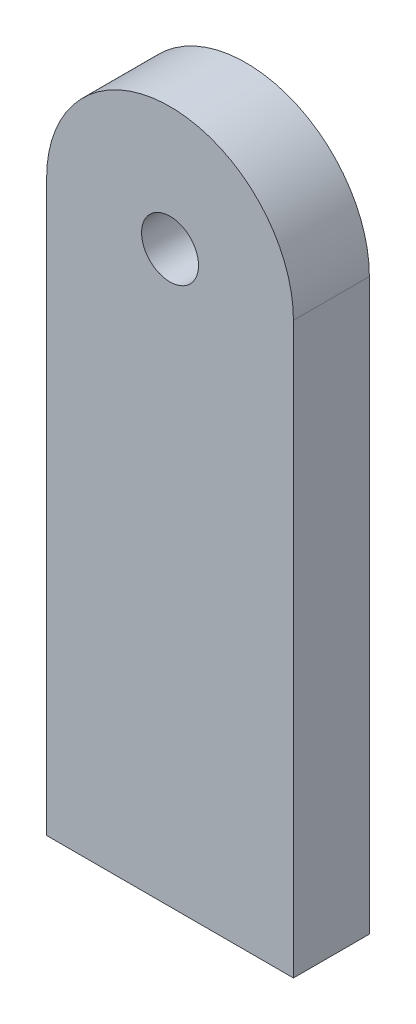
ISO-10303-21;
HEADER;
FILE_DESCRIPTION(('STEP AP214'),'2;1');
FILE_NAME('part.step','',(''),(''),'','','');
FILE_SCHEMA(('AUTOMOTIVE_DESIGN { 1 0 10303 214 1 1 1 1 }'));
ENDSEC;
DATA;
#1=APPLICATION_CONTEXT('core data for automotive mechanical design processes');
#2=APPLICATION_PROTOCOL_DEFINITION('international standard','automotive_design',2000,#1);
#3=PRODUCT_CONTEXT('',#1,'mechanical');
#4=PRODUCT('Part','Part','',(#3));
#5=PRODUCT_RELATED_PRODUCT_CATEGORY('part','',(#4));
#6=PRODUCT_DEFINITION_FORMATION('','',#4);
#7=PRODUCT_DEFINITION_CONTEXT('part definition',#1,'design');
#8=PRODUCT_DEFINITION('design','',#6,#7);
#9=PRODUCT_DEFINITION_SHAPE('','',#8);
#10=(LENGTH_UNIT() NAMED_UNIT(*) SI_UNIT(.MILLI.,.METRE.));
#11=(NAMED_UNIT(*) PLANE_ANGLE_UNIT() SI_UNIT($,.RADIAN.));
#12=(NAMED_UNIT(*) SI_UNIT($,.STERADIAN.) SOLID_ANGLE_UNIT());
#13=UNCERTAINTY_MEASURE_WITH_UNIT(LENGTH_MEASURE(1.E-05),#10,'distance_accuracy_value','');
#14=(GEOMETRIC_REPRESENTATION_CONTEXT(3) GLOBAL_UNCERTAINTY_ASSIGNED_CONTEXT((#13)) GLOBAL_UNIT_ASSIGNED_CONTEXT((#10,
#11,#12)) REPRESENTATION_CONTEXT('',''));
#15=CARTESIAN_POINT('',(0.,0.,0.));
#16=DIRECTION('',(0.,0.,1.));
#17=DIRECTION('',(1.,0.,0.));
#18=AXIS2_PLACEMENT_3D('',#15,#16,#17);
#19=CARTESIAN_POINT('',(0.,0.,5.08));
#20=DIRECTION('',(0.,0.,1.));
#21=DIRECTION('',(1.,0.,0.));
#22=AXIS2_PLACEMENT_3D('',#19,#20,#21);
#23=PLANE('',#22);
#24=CARTESIAN_POINT('',(0.,0.,5.08));
#25=DIRECTION('',(0.,0.,1.));
#26=DIRECTION('',(1.,0.,0.));
#27=AXIS2_PLACEMENT_3D('',#24,#25,#26);
#28=CIRCLE('',#27,16.51);
#29=CARTESIAN_POINT('',(16.51,0.,5.08));
#30=VERTEX_POINT('',#29);
#31=CARTESIAN_POINT('',(-16.51,0.,5.08));
#32=VERTEX_POINT('',#31);
#33=EDGE_CURVE('E85',#30,#32,#28,.T.);
#34=ORIENTED_EDGE('',*,*,#33,.T.);
#35=DIRECTION('',(0.,-1.,0.));
#36=VECTOR('',#35,1.);
#37=CARTESIAN_POINT('',(-16.51,0.,5.08));
#38=LINE('',#37,#36);
#39=CARTESIAN_POINT('',(-16.51,-76.2,5.08));
#40=VERTEX_POINT('',#39);
#41=EDGE_CURVE('E80',#32,#40,#38,.T.);
#42=ORIENTED_EDGE('',*,*,#41,.T.);
#43=DIRECTION('',(1.,0.,0.));
#44=VECTOR('',#43,1.);
#45=CARTESIAN_POINT('',(16.51,-76.2,5.08));
#46=LINE('',#45,#44);
#47=CARTESIAN_POINT('',(16.51,-76.2,5.08));
#48=VERTEX_POINT('',#47);
#49=EDGE_CURVE('E83',#40,#48,#46,.T.);
#50=ORIENTED_EDGE('',*,*,#49,.T.);
#51=DIRECTION('',(0.,1.,0.));
#52=VECTOR('',#51,1.);
#53=CARTESIAN_POINT('',(16.51,0.,5.08));
#54=LINE('',#53,#52);
#55=EDGE_CURVE('E50',#48,#30,#54,.T.);
#56=ORIENTED_EDGE('',*,*,#55,.T.);
#57=EDGE_LOOP('',(#34,#42,#50,#56));
#58=FACE_BOUND('',#57,.T.);
#59=CARTESIAN_POINT('',(0.,0.,5.08));
#60=DIRECTION('',(0.,0.,1.));
#61=DIRECTION('',(1.,0.,0.));
#62=AXIS2_PLACEMENT_3D('',#59,#60,#61);
#63=CIRCLE('',#62,3.81);
#64=CARTESIAN_POINT('',(3.81,0.,5.08));
#65=VERTEX_POINT('',#64);
#66=EDGE_CURVE('E100',#65,#65,#63,.T.);
#67=ORIENTED_EDGE('',*,*,#66,.F.);
#68=EDGE_LOOP('',(#67));
#69=FACE_BOUND('',#68,.T.);
#70=ADVANCED_FACE('F33',(#58,#69),#23,.T.);
#71=CARTESIAN_POINT('',(0.,0.,-5.08));
#72=DIRECTION('',(0.,0.,1.));
#73=DIRECTION('',(1.,0.,0.));
#74=AXIS2_PLACEMENT_3D('',#71,#72,#73);
#75=PLANE('',#74);
#76=CARTESIAN_POINT('',(0.,0.,-5.08));
#77=DIRECTION('',(0.,0.,1.));
#78=DIRECTION('',(1.,0.,0.));
#79=AXIS2_PLACEMENT_3D('',#76,#77,#78);
#80=CIRCLE('',#79,16.51);
#81=CARTESIAN_POINT('',(16.51,0.,-5.08));
#82=VERTEX_POINT('',#81);
#83=CARTESIAN_POINT('',(-16.51,0.,-5.08));
#84=VERTEX_POINT('',#83);
#85=EDGE_CURVE('E97',#82,#84,#80,.T.);
#86=ORIENTED_EDGE('',*,*,#85,.F.);
#87=DIRECTION('',(0.,1.,0.));
#88=VECTOR('',#87,1.);
#89=CARTESIAN_POINT('',(16.51,0.,-5.08));
#90=LINE('',#89,#88);
#91=CARTESIAN_POINT('',(16.51,-76.2,-5.08));
#92=VERTEX_POINT('',#91);
#93=EDGE_CURVE('E73',#92,#82,#90,.T.);
#94=ORIENTED_EDGE('',*,*,#93,.F.);
#95=DIRECTION('',(1.,0.,0.));
#96=VECTOR('',#95,1.);
#97=CARTESIAN_POINT('',(16.51,-76.2,-5.08));
#98=LINE('',#97,#96);
#99=CARTESIAN_POINT('',(-16.51,-76.2,-5.08));
#100=VERTEX_POINT('',#99);
#101=EDGE_CURVE('E67',#100,#92,#98,.T.);
#102=ORIENTED_EDGE('',*,*,#101,.F.);
#103=DIRECTION('',(0.,-1.,0.));
#104=VECTOR('',#103,1.);
#105=CARTESIAN_POINT('',(-16.51,0.,-5.08));
#106=LINE('',#105,#104);
#107=EDGE_CURVE('E89',#84,#100,#106,.T.);
#108=ORIENTED_EDGE('',*,*,#107,.F.);
#109=EDGE_LOOP('',(#86,#94,#102,#108));
#110=FACE_BOUND('',#109,.T.);
#111=CARTESIAN_POINT('',(0.,0.,-5.08));
#112=DIRECTION('',(0.,0.,1.));
#113=DIRECTION('',(1.,0.,0.));
#114=AXIS2_PLACEMENT_3D('',#111,#112,#113);
#115=CIRCLE('',#114,3.81);
#116=CARTESIAN_POINT('',(3.81,0.,-5.08));
#117=VERTEX_POINT('',#116);
#118=EDGE_CURVE('E112',#117,#117,#115,.T.);
#119=ORIENTED_EDGE('',*,*,#118,.T.);
#120=EDGE_LOOP('',(#119));
#121=FACE_BOUND('',#120,.T.);
#122=ADVANCED_FACE('F108',(#110,#121),#75,.F.);
#123=CARTESIAN_POINT('',(0.,0.,5.08));
#124=DIRECTION('',(0.,0.,-1.));
#125=DIRECTION('',(-1.,0.,0.));
#126=AXIS2_PLACEMENT_3D('',#123,#124,#125);
#127=CYLINDRICAL_SURFACE('',#126,16.51);
#128=ORIENTED_EDGE('',*,*,#85,.T.);
#129=DIRECTION('',(0.,0.,-1.));
#130=VECTOR('',#129,1.);
#131=CARTESIAN_POINT('',(-16.51,0.,5.08));
#132=LINE('',#131,#130);
#133=EDGE_CURVE('E11',#32,#84,#132,.T.);
#134=ORIENTED_EDGE('',*,*,#133,.F.);
#135=ORIENTED_EDGE('',*,*,#33,.F.);
#136=DIRECTION('',(0.,0.,-1.));
#137=VECTOR('',#136,1.);
#138=CARTESIAN_POINT('',(16.51,0.,5.08));
#139=LINE('',#138,#137);
#140=EDGE_CURVE('E93',#30,#82,#139,.T.);
#141=ORIENTED_EDGE('',*,*,#140,.T.);
#142=EDGE_LOOP('',(#128,#134,#135,#141));
#143=FACE_BOUND('',#142,.T.);
#144=ADVANCED_FACE('F35',(#143),#127,.T.);
#145=CARTESIAN_POINT('',(-16.51,0.,5.08));
#146=DIRECTION('',(1.,0.,0.));
#147=DIRECTION('',(0.,1.,0.));
#148=AXIS2_PLACEMENT_3D('',#145,#146,#147);
#149=PLANE('',#148);
#150=ORIENTED_EDGE('',*,*,#107,.T.);
#151=DIRECTION('',(0.,0.,-1.));
#152=VECTOR('',#151,1.);
#153=CARTESIAN_POINT('',(-16.51,-76.2,5.08));
#154=LINE('',#153,#152);
#155=EDGE_CURVE('E42',#40,#100,#154,.T.);
#156=ORIENTED_EDGE('',*,*,#155,.F.);
#157=ORIENTED_EDGE('',*,*,#41,.F.);
#158=ORIENTED_EDGE('',*,*,#133,.T.);
#159=EDGE_LOOP('',(#150,#156,#157,#158));
#160=FACE_BOUND('',#159,.T.);
#161=ADVANCED_FACE('F88',(#160),#149,.F.);
#162=CARTESIAN_POINT('',(16.51,-76.2,5.08));
#163=DIRECTION('',(0.,1.,0.));
#164=DIRECTION('',(0.,0.,1.));
#165=AXIS2_PLACEMENT_3D('',#162,#163,#164);
#166=PLANE('',#165);
#167=ORIENTED_EDGE('',*,*,#101,.T.);
#168=DIRECTION('',(0.,0.,-1.));
#169=VECTOR('',#168,1.);
#170=CARTESIAN_POINT('',(16.51,-76.2,5.08));
#171=LINE('',#170,#169);
#172=EDGE_CURVE('E90',#48,#92,#171,.T.);
#173=ORIENTED_EDGE('',*,*,#172,.F.);
#174=ORIENTED_EDGE('',*,*,#49,.F.);
#175=ORIENTED_EDGE('',*,*,#155,.T.);
#176=EDGE_LOOP('',(#167,#173,#174,#175));
#177=FACE_BOUND('',#176,.T.);
#178=ADVANCED_FACE('F91',(#177),#166,.F.);
#179=CARTESIAN_POINT('',(16.51,0.,5.08));
#180=DIRECTION('',(-1.,0.,0.));
#181=DIRECTION('',(0.,-1.,0.));
#182=AXIS2_PLACEMENT_3D('',#179,#180,#181);
#183=PLANE('',#182);
#184=ORIENTED_EDGE('',*,*,#93,.T.);
#185=ORIENTED_EDGE('',*,*,#140,.F.);
#186=ORIENTED_EDGE('',*,*,#55,.F.);
#187=ORIENTED_EDGE('',*,*,#172,.T.);
#188=EDGE_LOOP('',(#184,#185,#186,#187));
#189=FACE_BOUND('',#188,.T.);
#190=ADVANCED_FACE('F105',(#189),#183,.F.);
#191=CARTESIAN_POINT('',(0.,0.,5.08));
#192=DIRECTION('',(0.,0.,-1.));
#193=DIRECTION('',(-1.,0.,0.));
#194=AXIS2_PLACEMENT_3D('',#191,#192,#193);
#195=CYLINDRICAL_SURFACE('',#194,3.81);
#196=ORIENTED_EDGE('',*,*,#66,.T.);
#197=EDGE_LOOP('',(#196));
#198=FACE_BOUND('',#197,.T.);
#199=ORIENTED_EDGE('',*,*,#118,.F.);
#200=EDGE_LOOP('',(#199));
#201=FACE_BOUND('',#200,.T.);
#202=ADVANCED_FACE('F118',(#198,#201),#195,.F.);
#203=CLOSED_SHELL('',(#70,#122,#144,#161,#178,#190,#202));
#204=MANIFOLD_SOLID_BREP('B2',#203);
#205=ADVANCED_BREP_SHAPE_REPRESENTATION('',(#18,#204),#14);
#206=SHAPE_DEFINITION_REPRESENTATION(#9,#205);
ENDSEC;
END-ISO-10303-21;
